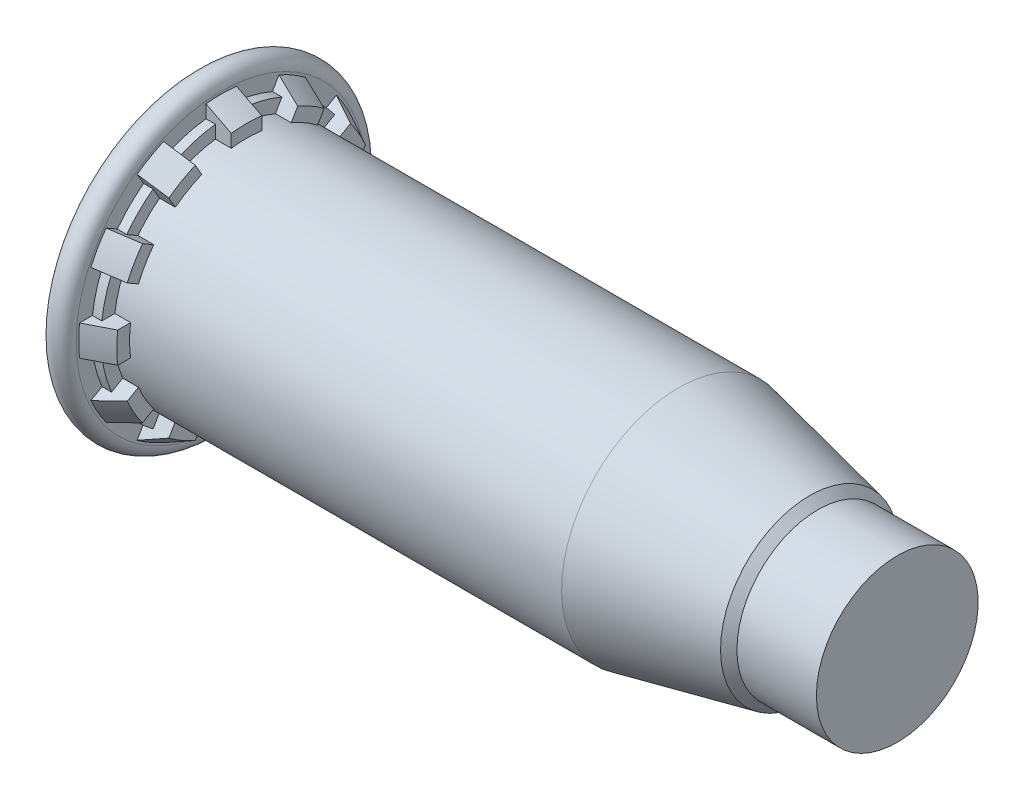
from build123d import *

# Parameters (mm, degrees)
RIBCUT1_DEPTH    = 0.428625
RIBCUT2_DEPTH    = 0.6858
RIBCUTSPAT_COUNT = 12
RIBCUTSPAT_ANGLE = 330


with BuildPart() as part:
    # BodySke → BaseBody (revolve)
    with BuildSketch(Plane.XY, mode=Mode.PRIVATE) as basebody_sk:
        with BuildLine():
            Line((0, 0), (0, 3.93446))
            Line((0, 3.93446), (0.00508, 3.93446))
            Line((0.00508, 3.93446), (0.00508, 3.93954))
            ThreePointArc((0.00508, 3.93954), (0.34544, 4.2799), (0.6858, 3.93954))
            Line((0.6858, 3.93954), (0.6858, 3.8735))
            Line((0.6858, 3.8735), (1.3716, 3.52425))
            Line((1.3716, 3.52425), (1.3716, 3.175))
            Line((1.3716, 3.175), (13.1064, 3.175))
            Line((13.1064, 3.175), (16.66875, 2.41935))
            Line((16.66875, 2.41935), (16.891, 2.1971))
            Line((16.891, 2.1971), (19.05, 2.1971))
            Line((19.05, 2.1971), (19.05, 0))
            Line((19.05, 0), (0, 0))
        make_face()
    revolve(basebody_sk.sketch.rotate(Axis((0, 0, 0), (1, 0, 0)), 90), axis=Axis((0, 0, 0), (1, 0, 0)))

    # RibCut1Ske → RibCut1 (cut)
    with BuildSketch(Plane(origin=(1.3716, 0, 0), x_dir=(0, 0, -1), z_dir=(1, 0, 0))):
        with BuildLine():
            Line((0.41442066, 3.147837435), (0.41442066, 4.259788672))
            ThreePointArc((0.41442066, 4.259788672), (1.107719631, 4.134065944), (1.770995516, 3.896295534))
            Line((1.770995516, 3.896295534), (1.215019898, 2.933317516))
            ThreePointArc((1.215019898, 2.933317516), (0.821750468, 3.066814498), (0.41442066, 3.147837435))
        make_face()
    ribcut1 = extrude(amount=-RIBCUT1_DEPTH, mode=Mode.SUBTRACT)

    # RibCut2Ske → RibCut2 (cut)
    with BuildSketch(Plane(origin=(1.3716, 0, 0), x_dir=(0, 0, -1), z_dir=(1, 0, 0))):
        with BuildLine():
            Line((0.41442066, 3.499799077), (0.41442066, 4.259788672))
            ThreePointArc((0.41442066, 4.259788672), (1.107719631, 4.134065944), (1.770995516, 3.896295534))
            Line((1.770995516, 3.896295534), (1.391000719, 3.238125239))
            ThreePointArc((1.391000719, 3.238125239), (0.91214302, 3.404164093), (0.41442066, 3.499799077))
        make_face()
    ribcut2 = extrude(amount=-RIBCUT2_DEPTH, mode=Mode.SUBTRACT)

    # RibCutsPat: RibCut1, RibCut2 ×12 about axis
    ribcutspat_axis = Axis((0, 0, 0), (1, 0, 0))
    add([ribcut1.rotate(ribcutspat_axis, i * RIBCUTSPAT_ANGLE / (RIBCUTSPAT_COUNT - 1)) for i in range(1, RIBCUTSPAT_COUNT)], mode=Mode.SUBTRACT)
    add([ribcut2.rotate(ribcutspat_axis, i * RIBCUTSPAT_ANGLE / (RIBCUTSPAT_COUNT - 1)) for i in range(1, RIBCUTSPAT_COUNT)], mode=Mode.SUBTRACT)


solid = part.part
